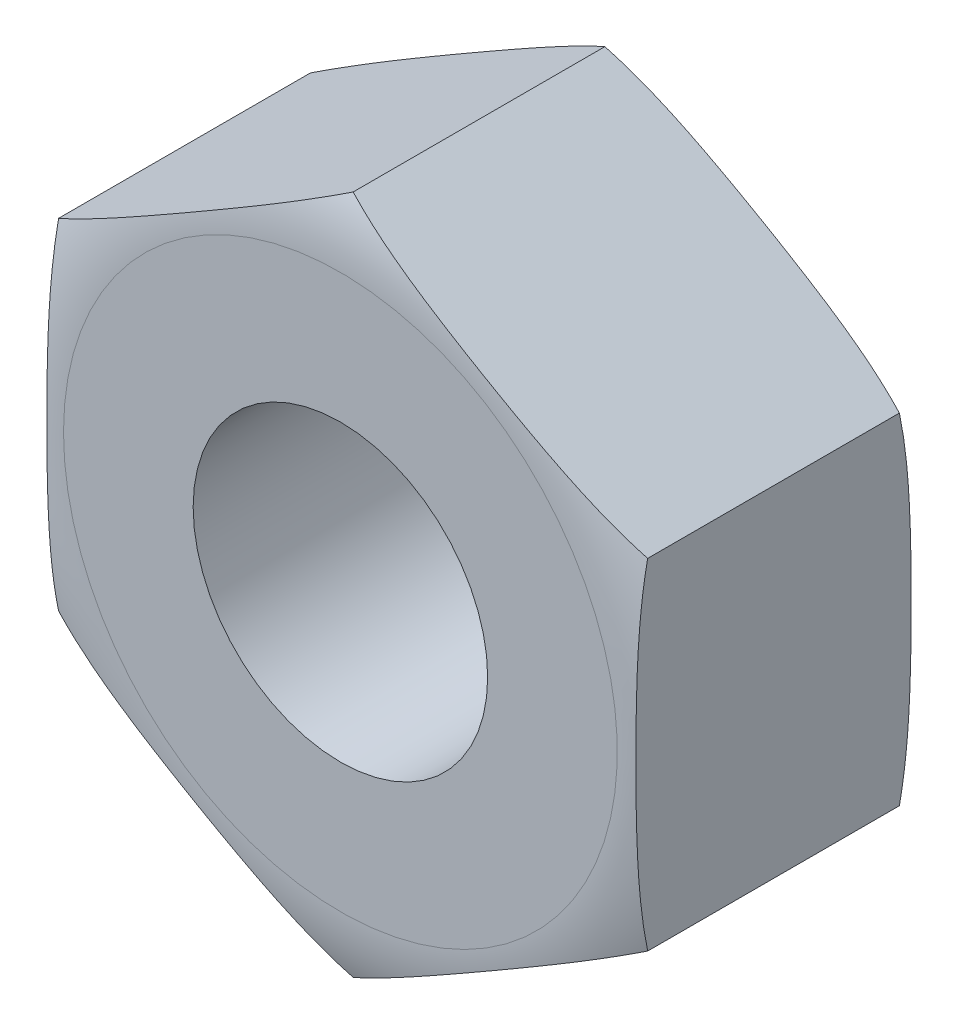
from build123d import *

# Parameters (mm, degrees)
AUFSATZ_LINEAR_AUSTRAGEN1_DEPTH = 8
M10_GEWINDEBOHRUNG1_D           = 8.5


with BuildPart() as part:
    # Skizze1 → Aufsatz-Linear austragen1 (new body)
    with BuildSketch(Plane.XY):
        Polygon((8.5, 4.907477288), (0, 9.814954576), (-8.5, 4.907477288), (-8.5, -4.907477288), (0, -9.814954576), (8.5, -4.907477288), align=None)
    extrude(amount=AUFSATZ_LINEAR_AUSTRAGEN1_DEPTH)

    # M10 Gewindebohrung1 (through all)
    with Locations(Plane.XY.offset(8)):
        with Locations((0, 0)):
            Hole(M10_GEWINDEBOHRUNG1_D / 2)

    # Skizze4 → Schnitt-Rotation1 (revolve, cut)
    with BuildSketch(Plane(origin=(0, 0, 0), x_dir=(1, 0, 0), z_dir=(0, 1, 0))):
        with BuildLine():
            Line((-10, -7.55), (-10, -8))
            Line((-10, -8), (-7.991547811, -8))
            ThreePointArc((-7.991547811, -8), (-9.020671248, -7.886122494), (-10, -7.55))
        make_face()
        with BuildLine():
            Line((-10, 0), (-7.991547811, 0))
            ThreePointArc((-7.991547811, 0), (-9.020671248, -0.113877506), (-10, -0.45))
            Line((-10, -0.45), (-10, 0))
        make_face()
    revolve(axis=Axis((0, 0, 0.715875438), (0, 0, 1)), mode=Mode.SUBTRACT)


solid = part.part
